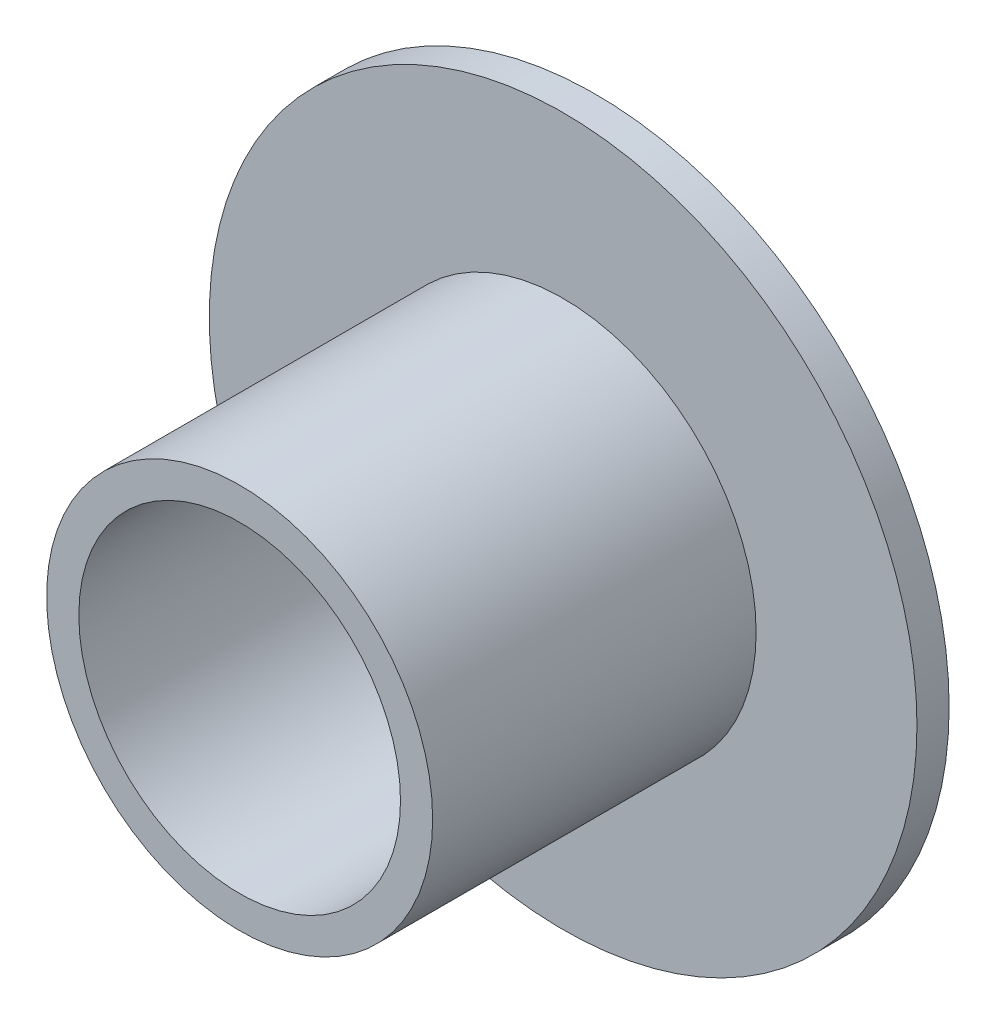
ISO-10303-21;
HEADER;
FILE_DESCRIPTION(('STEP AP214'),'2;1');
FILE_NAME('part.step','',(''),(''),'','','');
FILE_SCHEMA(('AUTOMOTIVE_DESIGN { 1 0 10303 214 1 1 1 1 }'));
ENDSEC;
DATA;
#1=APPLICATION_CONTEXT('core data for automotive mechanical design processes');
#2=APPLICATION_PROTOCOL_DEFINITION('international standard','automotive_design',2000,#1);
#3=PRODUCT_CONTEXT('',#1,'mechanical');
#4=PRODUCT('Part','Part','',(#3));
#5=PRODUCT_RELATED_PRODUCT_CATEGORY('part','',(#4));
#6=PRODUCT_DEFINITION_FORMATION('','',#4);
#7=PRODUCT_DEFINITION_CONTEXT('part definition',#1,'design');
#8=PRODUCT_DEFINITION('design','',#6,#7);
#9=PRODUCT_DEFINITION_SHAPE('','',#8);
#10=(LENGTH_UNIT() NAMED_UNIT(*) SI_UNIT(.MILLI.,.METRE.));
#11=(NAMED_UNIT(*) PLANE_ANGLE_UNIT() SI_UNIT($,.RADIAN.));
#12=(NAMED_UNIT(*) SI_UNIT($,.STERADIAN.) SOLID_ANGLE_UNIT());
#13=UNCERTAINTY_MEASURE_WITH_UNIT(LENGTH_MEASURE(1.E-05),#10,'distance_accuracy_value','');
#14=(GEOMETRIC_REPRESENTATION_CONTEXT(3) GLOBAL_UNCERTAINTY_ASSIGNED_CONTEXT((#13)) GLOBAL_UNIT_ASSIGNED_CONTEXT((#10,
#11,#12)) REPRESENTATION_CONTEXT('',''));
#15=CARTESIAN_POINT('',(0.,0.,0.));
#16=DIRECTION('',(0.,0.,1.));
#17=DIRECTION('',(1.,0.,0.));
#18=AXIS2_PLACEMENT_3D('',#15,#16,#17);
#19=CARTESIAN_POINT('',(0.,0.,0.));
#20=DIRECTION('',(0.,0.,1.));
#21=DIRECTION('',(1.,0.,0.));
#22=AXIS2_PLACEMENT_3D('',#19,#20,#21);
#23=PLANE('',#22);
#24=CARTESIAN_POINT('',(0.,0.,0.));
#25=DIRECTION('',(0.,0.,1.));
#26=DIRECTION('',(1.,0.,0.));
#27=AXIS2_PLACEMENT_3D('',#24,#25,#26);
#28=CIRCLE('',#27,110.);
#29=CARTESIAN_POINT('',(110.,0.,0.));
#30=VERTEX_POINT('',#29);
#31=EDGE_CURVE('E10',#30,#30,#28,.T.);
#32=ORIENTED_EDGE('',*,*,#31,.T.);
#33=EDGE_LOOP('',(#32));
#34=FACE_BOUND('',#33,.T.);
#35=CARTESIAN_POINT('',(0.,0.,0.));
#36=DIRECTION('',(0.,0.,1.));
#37=DIRECTION('',(1.,0.,0.));
#38=AXIS2_PLACEMENT_3D('',#35,#36,#37);
#39=CIRCLE('',#38,60.);
#40=CARTESIAN_POINT('',(60.,0.,0.));
#41=VERTEX_POINT('',#40);
#42=EDGE_CURVE('E55',#41,#41,#39,.T.);
#43=ORIENTED_EDGE('',*,*,#42,.F.);
#44=EDGE_LOOP('',(#43));
#45=FACE_BOUND('',#44,.T.);
#46=ADVANCED_FACE('F35',(#34,#45),#23,.T.);
#47=CARTESIAN_POINT('',(0.,0.,-10.));
#48=DIRECTION('',(0.,0.,1.));
#49=DIRECTION('',(1.,0.,0.));
#50=AXIS2_PLACEMENT_3D('',#47,#48,#49);
#51=PLANE('',#50);
#52=CARTESIAN_POINT('',(0.,0.,-10.));
#53=DIRECTION('',(0.,0.,1.));
#54=DIRECTION('',(1.,0.,0.));
#55=AXIS2_PLACEMENT_3D('',#52,#53,#54);
#56=CIRCLE('',#55,110.);
#57=CARTESIAN_POINT('',(110.,0.,-10.));
#58=VERTEX_POINT('',#57);
#59=EDGE_CURVE('E42',#58,#58,#56,.T.);
#60=ORIENTED_EDGE('',*,*,#59,.F.);
#61=EDGE_LOOP('',(#60));
#62=FACE_BOUND('',#61,.T.);
#63=CARTESIAN_POINT('',(0.,0.,-10.));
#64=DIRECTION('',(0.,0.,1.));
#65=DIRECTION('',(1.,0.,0.));
#66=AXIS2_PLACEMENT_3D('',#63,#64,#65);
#67=CIRCLE('',#66,50.);
#68=CARTESIAN_POINT('',(50.,0.,-10.));
#69=VERTEX_POINT('',#68);
#70=EDGE_CURVE('E46',#69,#69,#67,.T.);
#71=ORIENTED_EDGE('',*,*,#70,.T.);
#72=EDGE_LOOP('',(#71));
#73=FACE_BOUND('',#72,.T.);
#74=ADVANCED_FACE('F78',(#62,#73),#51,.F.);
#75=CARTESIAN_POINT('',(0.,0.,0.));
#76=DIRECTION('',(0.,0.,-1.));
#77=DIRECTION('',(-1.,0.,0.));
#78=AXIS2_PLACEMENT_3D('',#75,#76,#77);
#79=CYLINDRICAL_SURFACE('',#78,110.);
#80=ORIENTED_EDGE('',*,*,#31,.F.);
#81=EDGE_LOOP('',(#80));
#82=FACE_BOUND('',#81,.T.);
#83=ORIENTED_EDGE('',*,*,#59,.T.);
#84=EDGE_LOOP('',(#83));
#85=FACE_BOUND('',#84,.T.);
#86=ADVANCED_FACE('F37',(#82,#85),#79,.T.);
#87=CARTESIAN_POINT('',(0.,0.,0.));
#88=DIRECTION('',(0.,0.,-1.));
#89=DIRECTION('',(-1.,0.,0.));
#90=AXIS2_PLACEMENT_3D('',#87,#88,#89);
#91=CYLINDRICAL_SURFACE('',#90,50.);
#92=ORIENTED_EDGE('',*,*,#70,.F.);
#93=EDGE_LOOP('',(#92));
#94=FACE_BOUND('',#93,.T.);
#95=CARTESIAN_POINT('',(0.,0.,100.55));
#96=DIRECTION('',(0.,0.,1.));
#97=DIRECTION('',(1.,0.,0.));
#98=AXIS2_PLACEMENT_3D('',#95,#96,#97);
#99=CIRCLE('',#98,50.);
#100=CARTESIAN_POINT('',(50.,0.,100.55));
#101=VERTEX_POINT('',#100);
#102=EDGE_CURVE('E58',#101,#101,#99,.T.);
#103=ORIENTED_EDGE('',*,*,#102,.T.);
#104=EDGE_LOOP('',(#103));
#105=FACE_BOUND('',#104,.T.);
#106=ADVANCED_FACE('F62',(#94,#105),#91,.F.);
#107=CARTESIAN_POINT('',(0.,0.,100.55));
#108=DIRECTION('',(0.,0.,1.));
#109=DIRECTION('',(1.,0.,0.));
#110=AXIS2_PLACEMENT_3D('',#107,#108,#109);
#111=PLANE('',#110);
#112=CARTESIAN_POINT('',(0.,0.,100.55));
#113=DIRECTION('',(0.,0.,1.));
#114=DIRECTION('',(1.,0.,0.));
#115=AXIS2_PLACEMENT_3D('',#112,#113,#114);
#116=CIRCLE('',#115,60.);
#117=CARTESIAN_POINT('',(60.,0.,100.55));
#118=VERTEX_POINT('',#117);
#119=EDGE_CURVE('E50',#118,#118,#116,.T.);
#120=ORIENTED_EDGE('',*,*,#119,.T.);
#121=EDGE_LOOP('',(#120));
#122=FACE_BOUND('',#121,.T.);
#123=ORIENTED_EDGE('',*,*,#102,.F.);
#124=EDGE_LOOP('',(#123));
#125=FACE_BOUND('',#124,.T.);
#126=ADVANCED_FACE('F64',(#122,#125),#111,.T.);
#127=CARTESIAN_POINT('',(0.,0.,100.55));
#128=DIRECTION('',(0.,0.,-1.));
#129=DIRECTION('',(-1.,0.,0.));
#130=AXIS2_PLACEMENT_3D('',#127,#128,#129);
#131=CYLINDRICAL_SURFACE('',#130,60.);
#132=ORIENTED_EDGE('',*,*,#119,.F.);
#133=EDGE_LOOP('',(#132));
#134=FACE_BOUND('',#133,.T.);
#135=ORIENTED_EDGE('',*,*,#42,.T.);
#136=EDGE_LOOP('',(#135));
#137=FACE_BOUND('',#136,.T.);
#138=ADVANCED_FACE('F66',(#134,#137),#131,.T.);
#139=CLOSED_SHELL('',(#46,#74,#86,#106,#126,#138));
#140=MANIFOLD_SOLID_BREP('B2',#139);
#141=ADVANCED_BREP_SHAPE_REPRESENTATION('',(#18,#140),#14);
#142=SHAPE_DEFINITION_REPRESENTATION(#9,#141);
ENDSEC;
END-ISO-10303-21;
